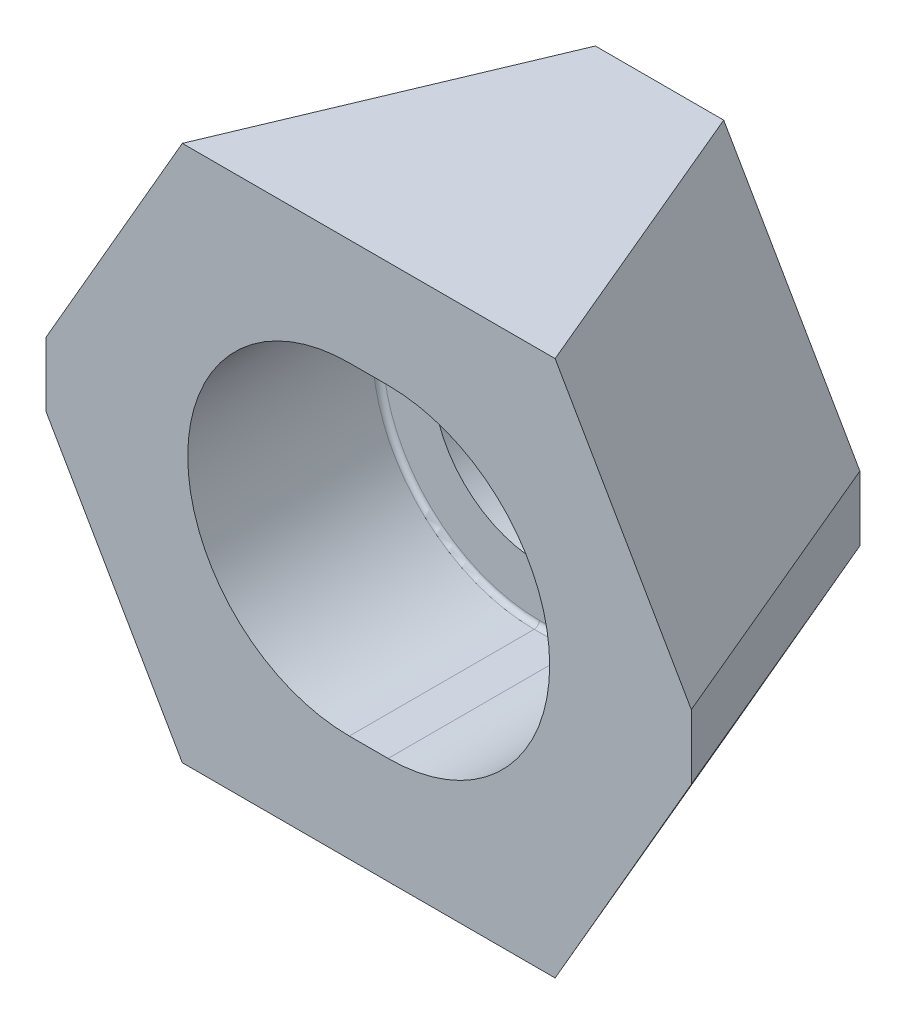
ISO-10303-21;
HEADER;
FILE_DESCRIPTION(('STEP AP214'),'2;1');
FILE_NAME('part.step','',(''),(''),'','','');
FILE_SCHEMA(('AUTOMOTIVE_DESIGN { 1 0 10303 214 1 1 1 1 }'));
ENDSEC;
DATA;
#1=APPLICATION_CONTEXT('core data for automotive mechanical design processes');
#2=APPLICATION_PROTOCOL_DEFINITION('international standard','automotive_design',2000,#1);
#3=PRODUCT_CONTEXT('',#1,'mechanical');
#4=PRODUCT('Part','Part','',(#3));
#5=PRODUCT_RELATED_PRODUCT_CATEGORY('part','',(#4));
#6=PRODUCT_DEFINITION_FORMATION('','',#4);
#7=PRODUCT_DEFINITION_CONTEXT('part definition',#1,'design');
#8=PRODUCT_DEFINITION('design','',#6,#7);
#9=PRODUCT_DEFINITION_SHAPE('','',#8);
#10=(LENGTH_UNIT() NAMED_UNIT(*) SI_UNIT(.MILLI.,.METRE.));
#11=(NAMED_UNIT(*) PLANE_ANGLE_UNIT() SI_UNIT($,.RADIAN.));
#12=(NAMED_UNIT(*) SI_UNIT($,.STERADIAN.) SOLID_ANGLE_UNIT());
#13=UNCERTAINTY_MEASURE_WITH_UNIT(LENGTH_MEASURE(1.E-05),#10,'distance_accuracy_value','');
#14=(GEOMETRIC_REPRESENTATION_CONTEXT(3) GLOBAL_UNCERTAINTY_ASSIGNED_CONTEXT((#13)) GLOBAL_UNIT_ASSIGNED_CONTEXT((#10,
#11,#12)) REPRESENTATION_CONTEXT('',''));
#15=CARTESIAN_POINT('',(0.,0.,0.));
#16=DIRECTION('',(0.,0.,1.));
#17=DIRECTION('',(1.,0.,0.));
#18=AXIS2_PLACEMENT_3D('',#15,#16,#17);
#19=CARTESIAN_POINT('',(-1.5,0.,22.6));
#20=DIRECTION('',(0.,0.,-1.));
#21=DIRECTION('',(-1.,0.,0.));
#22=AXIS2_PLACEMENT_3D('',#19,#20,#21);
#23=CYLINDRICAL_SURFACE('',#22,8.25);
#24=DIRECTION('',(0.,0.,-1.));
#25=VECTOR('',#24,1.);
#26=CARTESIAN_POINT('',(-1.5,-8.25,22.6));
#27=LINE('',#26,#25);
#28=CARTESIAN_POINT('',(-1.5,-8.25,7.8));
#29=VERTEX_POINT('',#28);
#30=CARTESIAN_POINT('',(-1.5,-8.25,0.));
#31=VERTEX_POINT('',#30);
#32=EDGE_CURVE('E122',#29,#31,#27,.T.);
#33=ORIENTED_EDGE('',*,*,#32,.T.);
#34=CARTESIAN_POINT('',(-1.5,0.,0.));
#35=DIRECTION('',(0.,0.,-1.));
#36=DIRECTION('',(-1.,0.,0.));
#37=AXIS2_PLACEMENT_3D('',#34,#35,#36);
#38=CIRCLE('',#37,8.25);
#39=CARTESIAN_POINT('',(-1.5,8.25,0.));
#40=VERTEX_POINT('',#39);
#41=EDGE_CURVE('E136',#31,#40,#38,.T.);
#42=ORIENTED_EDGE('',*,*,#41,.T.);
#43=DIRECTION('',(0.,0.,1.));
#44=VECTOR('',#43,1.);
#45=CARTESIAN_POINT('',(-1.5,8.25,22.6));
#46=LINE('',#45,#44);
#47=CARTESIAN_POINT('',(-1.5,8.25,7.8));
#48=VERTEX_POINT('',#47);
#49=EDGE_CURVE('E154',#40,#48,#46,.T.);
#50=ORIENTED_EDGE('',*,*,#49,.T.);
#51=CARTESIAN_POINT('',(-1.5,0.,7.8));
#52=DIRECTION('',(0.,0.,-1.));
#53=DIRECTION('',(-1.,0.,0.));
#54=AXIS2_PLACEMENT_3D('',#51,#52,#53);
#55=CIRCLE('',#54,8.25);
#56=EDGE_CURVE('E130',#29,#48,#55,.T.);
#57=ORIENTED_EDGE('',*,*,#56,.F.);
#58=EDGE_LOOP('',(#33,#42,#50,#57));
#59=FACE_BOUND('',#58,.T.);
#60=ADVANCED_FACE('F14',(#59),#23,.F.);
#61=CARTESIAN_POINT('',(1.5,8.25,22.6));
#62=DIRECTION('',(0.,1.,0.));
#63=DIRECTION('',(0.,0.,1.));
#64=AXIS2_PLACEMENT_3D('',#61,#62,#63);
#65=PLANE('',#64);
#66=ORIENTED_EDGE('',*,*,#49,.F.);
#67=DIRECTION('',(1.,0.,0.));
#68=VECTOR('',#67,1.);
#69=CARTESIAN_POINT('',(0.,8.25,0.));
#70=LINE('',#69,#68);
#71=CARTESIAN_POINT('',(1.5,8.25,0.));
#72=VERTEX_POINT('',#71);
#73=EDGE_CURVE('E138',#40,#72,#70,.T.);
#74=ORIENTED_EDGE('',*,*,#73,.T.);
#75=DIRECTION('',(0.,0.,-1.));
#76=VECTOR('',#75,1.);
#77=CARTESIAN_POINT('',(1.5,8.25,22.6));
#78=LINE('',#77,#76);
#79=CARTESIAN_POINT('',(1.5,8.25,7.8));
#80=VERTEX_POINT('',#79);
#81=EDGE_CURVE('E107',#72,#80,#78,.F.);
#82=ORIENTED_EDGE('',*,*,#81,.T.);
#83=DIRECTION('',(1.,0.,0.));
#84=VECTOR('',#83,1.);
#85=CARTESIAN_POINT('',(0.,8.25,7.8));
#86=LINE('',#85,#84);
#87=EDGE_CURVE('E134',#48,#80,#86,.T.);
#88=ORIENTED_EDGE('',*,*,#87,.F.);
#89=EDGE_LOOP('',(#66,#74,#82,#88));
#90=FACE_BOUND('',#89,.T.);
#91=ADVANCED_FACE('F491',(#90),#65,.F.);
#92=CARTESIAN_POINT('',(1.5,0.,22.6));
#93=DIRECTION('',(0.,0.,-1.));
#94=DIRECTION('',(-1.,0.,0.));
#95=AXIS2_PLACEMENT_3D('',#92,#93,#94);
#96=CYLINDRICAL_SURFACE('',#95,8.25);
#97=ORIENTED_EDGE('',*,*,#81,.F.);
#98=CARTESIAN_POINT('',(1.5,0.,0.));
#99=DIRECTION('',(0.,0.,-1.));
#100=DIRECTION('',(-1.,0.,0.));
#101=AXIS2_PLACEMENT_3D('',#98,#99,#100);
#102=CIRCLE('',#101,8.25);
#103=CARTESIAN_POINT('',(1.5,-8.25,0.));
#104=VERTEX_POINT('',#103);
#105=EDGE_CURVE('E118',#72,#104,#102,.T.);
#106=ORIENTED_EDGE('',*,*,#105,.T.);
#107=DIRECTION('',(0.,0.,-1.));
#108=VECTOR('',#107,1.);
#109=CARTESIAN_POINT('',(1.5,-8.25,22.6));
#110=LINE('',#109,#108);
#111=CARTESIAN_POINT('',(1.5,-8.25,7.8));
#112=VERTEX_POINT('',#111);
#113=EDGE_CURVE('E112',#104,#112,#110,.F.);
#114=ORIENTED_EDGE('',*,*,#113,.T.);
#115=CARTESIAN_POINT('',(1.5,0.,7.8));
#116=DIRECTION('',(0.,0.,-1.));
#117=DIRECTION('',(-1.,0.,0.));
#118=AXIS2_PLACEMENT_3D('',#115,#116,#117);
#119=CIRCLE('',#118,8.25);
#120=EDGE_CURVE('E18',#80,#112,#119,.T.);
#121=ORIENTED_EDGE('',*,*,#120,.F.);
#122=EDGE_LOOP('',(#97,#106,#114,#121));
#123=FACE_BOUND('',#122,.T.);
#124=ADVANCED_FACE('F114',(#123),#96,.F.);
#125=CARTESIAN_POINT('',(-1.5,-8.25,22.6));
#126=DIRECTION('',(0.,-1.,0.));
#127=DIRECTION('',(0.,0.,-1.));
#128=AXIS2_PLACEMENT_3D('',#125,#126,#127);
#129=PLANE('',#128);
#130=ORIENTED_EDGE('',*,*,#113,.F.);
#131=DIRECTION('',(1.,0.,0.));
#132=VECTOR('',#131,1.);
#133=CARTESIAN_POINT('',(0.,-8.25,0.));
#134=LINE('',#133,#132);
#135=EDGE_CURVE('E150',#104,#31,#134,.F.);
#136=ORIENTED_EDGE('',*,*,#135,.T.);
#137=ORIENTED_EDGE('',*,*,#32,.F.);
#138=DIRECTION('',(1.,0.,0.));
#139=VECTOR('',#138,1.);
#140=CARTESIAN_POINT('',(0.,-8.25,7.8));
#141=LINE('',#140,#139);
#142=EDGE_CURVE('E125',#112,#29,#141,.F.);
#143=ORIENTED_EDGE('',*,*,#142,.F.);
#144=EDGE_LOOP('',(#130,#136,#137,#143));
#145=FACE_BOUND('',#144,.T.);
#146=ADVANCED_FACE('F126',(#145),#129,.F.);
#147=CARTESIAN_POINT('',(0.,0.,7.8));
#148=DIRECTION('',(0.,0.,1.));
#149=DIRECTION('',(1.,0.,0.));
#150=AXIS2_PLACEMENT_3D('',#147,#148,#149);
#151=PLANE('',#150);
#152=ORIENTED_EDGE('',*,*,#56,.T.);
#153=ORIENTED_EDGE('',*,*,#87,.T.);
#154=ORIENTED_EDGE('',*,*,#120,.T.);
#155=ORIENTED_EDGE('',*,*,#142,.T.);
#156=EDGE_LOOP('',(#152,#153,#154,#155));
#157=FACE_BOUND('',#156,.T.);
#158=CARTESIAN_POINT('',(1.5,0.,7.8));
#159=DIRECTION('',(0.,0.,1.));
#160=DIRECTION('',(1.,0.,0.));
#161=AXIS2_PLACEMENT_3D('',#158,#159,#160);
#162=CIRCLE('',#161,12.1);
#163=CARTESIAN_POINT('',(1.5,12.1,7.8));
#164=VERTEX_POINT('',#163);
#165=CARTESIAN_POINT('',(1.5,-12.1,7.8));
#166=VERTEX_POINT('',#165);
#167=EDGE_CURVE('E147',#164,#166,#162,.F.);
#168=ORIENTED_EDGE('',*,*,#167,.F.);
#169=DIRECTION('',(-1.,0.,0.));
#170=VECTOR('',#169,1.);
#171=CARTESIAN_POINT('',(0.75,12.1,7.8));
#172=LINE('',#171,#170);
#173=CARTESIAN_POINT('',(-1.5,12.1,7.8));
#174=VERTEX_POINT('',#173);
#175=EDGE_CURVE('E148',#164,#174,#172,.T.);
#176=ORIENTED_EDGE('',*,*,#175,.T.);
#177=CARTESIAN_POINT('',(-1.5,0.,7.8));
#178=DIRECTION('',(0.,0.,1.));
#179=DIRECTION('',(1.,0.,0.));
#180=AXIS2_PLACEMENT_3D('',#177,#178,#179);
#181=CIRCLE('',#180,12.1);
#182=CARTESIAN_POINT('',(-1.5,-12.1,7.8));
#183=VERTEX_POINT('',#182);
#184=EDGE_CURVE('E188',#183,#174,#181,.F.);
#185=ORIENTED_EDGE('',*,*,#184,.F.);
#186=DIRECTION('',(1.,0.,0.));
#187=VECTOR('',#186,1.);
#188=CARTESIAN_POINT('',(-0.75,-12.1,7.8));
#189=LINE('',#188,#187);
#190=EDGE_CURVE('E144',#183,#166,#189,.T.);
#191=ORIENTED_EDGE('',*,*,#190,.T.);
#192=EDGE_LOOP('',(#168,#176,#185,#191));
#193=FACE_BOUND('',#192,.T.);
#194=ADVANCED_FACE('F132',(#157,#193),#151,.T.);
#195=CARTESIAN_POINT('',(0.,0.,0.));
#196=DIRECTION('',(0.,0.,1.));
#197=DIRECTION('',(1.,0.,0.));
#198=AXIS2_PLACEMENT_3D('',#195,#196,#197);
#199=PLANE('',#198);
#200=ORIENTED_EDGE('',*,*,#105,.F.);
#201=ORIENTED_EDGE('',*,*,#73,.F.);
#202=ORIENTED_EDGE('',*,*,#41,.F.);
#203=ORIENTED_EDGE('',*,*,#135,.F.);
#204=EDGE_LOOP('',(#200,#201,#202,#203));
#205=FACE_BOUND('',#204,.T.);
#206=DIRECTION('',(0.,1.,0.));
#207=VECTOR('',#206,1.);
#208=CARTESIAN_POINT('',(15.4998347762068,10.375,0.));
#209=LINE('',#208,#207);
#210=CARTESIAN_POINT('',(15.4998347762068,-2.50331425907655,0.));
#211=VERTEX_POINT('',#210);
#212=CARTESIAN_POINT('',(15.4998347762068,2.50331425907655,0.));
#213=VERTEX_POINT('',#212);
#214=EDGE_CURVE('E207',#211,#213,#209,.T.);
#215=ORIENTED_EDGE('',*,*,#214,.F.);
#216=DIRECTION('',(0.5,0.866025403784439,0.));
#217=VECTOR('',#216,1.);
#218=CARTESIAN_POINT('',(15.2925770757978,-2.86229512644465,0.));
#219=LINE('',#218,#217);
#220=CARTESIAN_POINT('',(4.9651058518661,-20.75,0.));
#221=VERTEX_POINT('',#220);
#222=EDGE_CURVE('E213',#221,#211,#219,.T.);
#223=ORIENTED_EDGE('',*,*,#222,.F.);
#224=DIRECTION('',(1.,0.,0.));
#225=VECTOR('',#224,1.);
#226=CARTESIAN_POINT('',(25.,-20.75,0.));
#227=LINE('',#226,#225);
#228=CARTESIAN_POINT('',(-4.9651058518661,-20.75,0.));
#229=VERTEX_POINT('',#228);
#230=EDGE_CURVE('E219',#229,#221,#227,.T.);
#231=ORIENTED_EDGE('',*,*,#230,.F.);
#232=DIRECTION('',(0.5,-0.866025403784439,0.));
#233=VECTOR('',#232,1.);
#234=CARTESIAN_POINT('',(-10.0242558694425,-11.9872951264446,0.));
#235=LINE('',#234,#233);
#236=CARTESIAN_POINT('',(-15.4998347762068,-2.50331425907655,0.));
#237=VERTEX_POINT('',#236);
#238=EDGE_CURVE('E225',#237,#229,#235,.T.);
#239=ORIENTED_EDGE('',*,*,#238,.F.);
#240=DIRECTION('',(0.,1.,0.));
#241=VECTOR('',#240,1.);
#242=CARTESIAN_POINT('',(-15.4998347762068,-10.375,0.));
#243=LINE('',#242,#241);
#244=CARTESIAN_POINT('',(-15.4998347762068,2.50331425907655,0.));
#245=VERTEX_POINT('',#244);
#246=EDGE_CURVE('E230',#245,#237,#243,.F.);
#247=ORIENTED_EDGE('',*,*,#246,.F.);
#248=DIRECTION('',(-0.5,-0.866025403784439,0.));
#249=VECTOR('',#248,1.);
#250=CARTESIAN_POINT('',(-15.2925770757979,2.86229512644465,0.));
#251=LINE('',#250,#249);
#252=CARTESIAN_POINT('',(-4.9651058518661,20.75,0.));
#253=VERTEX_POINT('',#252);
#254=EDGE_CURVE('E191',#253,#245,#251,.T.);
#255=ORIENTED_EDGE('',*,*,#254,.F.);
#256=DIRECTION('',(1.,0.,0.));
#257=VECTOR('',#256,1.);
#258=CARTESIAN_POINT('',(-25.,20.75,0.));
#259=LINE('',#258,#257);
#260=CARTESIAN_POINT('',(4.9651058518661,20.75,0.));
#261=VERTEX_POINT('',#260);
#262=EDGE_CURVE('E292',#261,#253,#259,.F.);
#263=ORIENTED_EDGE('',*,*,#262,.F.);
#264=DIRECTION('',(-0.5,0.866025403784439,0.));
#265=VECTOR('',#264,1.);
#266=CARTESIAN_POINT('',(10.0242558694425,11.9872951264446,0.));
#267=LINE('',#266,#265);
#268=EDGE_CURVE('E200',#213,#261,#267,.T.);
#269=ORIENTED_EDGE('',*,*,#268,.F.);
#270=EDGE_LOOP('',(#215,#223,#231,#239,#247,#255,#263,#269));
#271=FACE_BOUND('',#270,.T.);
#272=ADVANCED_FACE('F337',(#205,#271),#199,.F.);
#273=CARTESIAN_POINT('',(0.75,12.1,8.2));
#274=DIRECTION('',(-1.,0.,0.));
#275=DIRECTION('',(0.,0.,1.));
#276=AXIS2_PLACEMENT_3D('',#273,#274,#275);
#277=CYLINDRICAL_SURFACE('',#276,0.4);
#278=DIRECTION('',(1.,0.,0.));
#279=VECTOR('',#278,1.);
#280=CARTESIAN_POINT('',(1.5,12.5,8.2));
#281=LINE('',#280,#279);
#282=CARTESIAN_POINT('',(1.5,12.5,8.2));
#283=VERTEX_POINT('',#282);
#284=CARTESIAN_POINT('',(-1.5,12.5,8.2));
#285=VERTEX_POINT('',#284);
#286=EDGE_CURVE('E271',#283,#285,#281,.F.);
#287=ORIENTED_EDGE('',*,*,#286,.T.);
#288=CARTESIAN_POINT('',(-1.5,12.1,8.2));
#289=DIRECTION('',(1.,0.,0.));
#290=DIRECTION('',(0.,1.,0.));
#291=AXIS2_PLACEMENT_3D('',#288,#289,#290);
#292=CIRCLE('',#291,0.4);
#293=EDGE_CURVE('E264',#174,#285,#292,.T.);
#294=ORIENTED_EDGE('',*,*,#293,.F.);
#295=ORIENTED_EDGE('',*,*,#175,.F.);
#296=CARTESIAN_POINT('',(1.5,12.1,8.2));
#297=DIRECTION('',(-1.,0.,0.));
#298=DIRECTION('',(0.,0.,1.));
#299=AXIS2_PLACEMENT_3D('',#296,#297,#298);
#300=CIRCLE('',#299,0.4);
#301=EDGE_CURVE('E149',#283,#164,#300,.T.);
#302=ORIENTED_EDGE('',*,*,#301,.F.);
#303=EDGE_LOOP('',(#287,#294,#295,#302));
#304=FACE_BOUND('',#303,.T.);
#305=ADVANCED_FACE('F455',(#304),#277,.F.);
#306=CARTESIAN_POINT('',(1.5,0.,8.2));
#307=DIRECTION('',(0.,0.,1.));
#308=DIRECTION('',(1.,0.,0.));
#309=AXIS2_PLACEMENT_3D('',#306,#307,#308);
#310=TOROIDAL_SURFACE('',#309,12.1,0.4);
#311=CARTESIAN_POINT('',(1.5,-12.1,8.2));
#312=DIRECTION('',(1.,0.,0.));
#313=DIRECTION('',(0.,0.,-1.));
#314=AXIS2_PLACEMENT_3D('',#311,#312,#313);
#315=CIRCLE('',#314,0.4);
#316=CARTESIAN_POINT('',(1.5,-12.5,8.2));
#317=VERTEX_POINT('',#316);
#318=EDGE_CURVE('E146',#166,#317,#315,.F.);
#319=ORIENTED_EDGE('',*,*,#318,.T.);
#320=CARTESIAN_POINT('',(1.5,0.,8.2));
#321=DIRECTION('',(0.,0.,-1.));
#322=DIRECTION('',(-1.,0.,0.));
#323=AXIS2_PLACEMENT_3D('',#320,#321,#322);
#324=CIRCLE('',#323,12.5);
#325=EDGE_CURVE('E274',#317,#283,#324,.F.);
#326=ORIENTED_EDGE('',*,*,#325,.T.);
#327=ORIENTED_EDGE('',*,*,#301,.T.);
#328=ORIENTED_EDGE('',*,*,#167,.T.);
#329=EDGE_LOOP('',(#319,#326,#327,#328));
#330=FACE_BOUND('',#329,.T.);
#331=ADVANCED_FACE('F460',(#330),#310,.F.);
#332=CARTESIAN_POINT('',(-0.75,-12.1,8.2));
#333=DIRECTION('',(1.,0.,0.));
#334=DIRECTION('',(0.,0.,-1.));
#335=AXIS2_PLACEMENT_3D('',#332,#333,#334);
#336=CYLINDRICAL_SURFACE('',#335,0.4);
#337=ORIENTED_EDGE('',*,*,#190,.F.);
#338=CARTESIAN_POINT('',(-1.5,-12.1,8.2));
#339=DIRECTION('',(1.,0.,0.));
#340=DIRECTION('',(0.,1.,0.));
#341=AXIS2_PLACEMENT_3D('',#338,#339,#340);
#342=CIRCLE('',#341,0.4);
#343=CARTESIAN_POINT('',(-1.5,-12.5,8.2));
#344=VERTEX_POINT('',#343);
#345=EDGE_CURVE('E192',#344,#183,#342,.T.);
#346=ORIENTED_EDGE('',*,*,#345,.F.);
#347=DIRECTION('',(1.,0.,0.));
#348=VECTOR('',#347,1.);
#349=CARTESIAN_POINT('',(-1.5,-12.5,8.2));
#350=LINE('',#349,#348);
#351=EDGE_CURVE('E249',#344,#317,#350,.T.);
#352=ORIENTED_EDGE('',*,*,#351,.T.);
#353=ORIENTED_EDGE('',*,*,#318,.F.);
#354=EDGE_LOOP('',(#337,#346,#352,#353));
#355=FACE_BOUND('',#354,.T.);
#356=ADVANCED_FACE('F470',(#355),#336,.F.);
#357=CARTESIAN_POINT('',(-1.5,0.,8.2));
#358=DIRECTION('',(0.,0.,1.));
#359=DIRECTION('',(1.,0.,0.));
#360=AXIS2_PLACEMENT_3D('',#357,#358,#359);
#361=TOROIDAL_SURFACE('',#360,12.1,0.4);
#362=ORIENTED_EDGE('',*,*,#345,.T.);
#363=ORIENTED_EDGE('',*,*,#184,.T.);
#364=ORIENTED_EDGE('',*,*,#293,.T.);
#365=CARTESIAN_POINT('',(-1.5,0.,8.2));
#366=DIRECTION('',(0.,0.,-1.));
#367=DIRECTION('',(-1.,0.,0.));
#368=AXIS2_PLACEMENT_3D('',#365,#366,#367);
#369=CIRCLE('',#368,12.5);
#370=EDGE_CURVE('E256',#285,#344,#369,.F.);
#371=ORIENTED_EDGE('',*,*,#370,.T.);
#372=EDGE_LOOP('',(#362,#363,#364,#371));
#373=FACE_BOUND('',#372,.T.);
#374=ADVANCED_FACE('F16',(#373),#361,.F.);
#375=CARTESIAN_POINT('',(-18.8544214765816,4.9187269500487,11.3));
#376=DIRECTION('',(-0.813797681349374,0.469846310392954,-0.342020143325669));
#377=DIRECTION('',(-0.5,-0.866025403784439,0.));
#378=AXIS2_PLACEMENT_3D('',#375,#376,#377);
#379=PLANE('',#378);
#380=ORIENTED_EDGE('',*,*,#254,.T.);
#381=DIRECTION('',(0.387515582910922,0.00013518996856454,-0.921863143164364));
#382=VECTOR('',#381,1.);
#383=CARTESIAN_POINT('',(-24.9579638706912,2.5000146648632,22.5));
#384=LINE('',#383,#382);
#385=CARTESIAN_POINT('',(-24.9579638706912,2.50001466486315,22.5));
#386=VERTEX_POINT('',#385);
#387=EDGE_CURVE('E232',#386,#245,#384,.T.);
#388=ORIENTED_EDGE('',*,*,#387,.F.);
#389=DIRECTION('',(-0.5,-0.866025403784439,0.));
#390=VECTOR('',#389,1.);
#391=CARTESIAN_POINT('',(-14.4213299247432,20.75,22.5));
#392=LINE('',#391,#390);
#393=CARTESIAN_POINT('',(-14.4213299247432,20.75,22.5));
#394=VERTEX_POINT('',#393);
#395=EDGE_CURVE('E185',#394,#386,#392,.T.);
#396=ORIENTED_EDGE('',*,*,#395,.F.);
#397=DIRECTION('',(-0.387449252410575,0.,0.921891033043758));
#398=VECTOR('',#397,1.);
#399=CARTESIAN_POINT('',(-4.9651058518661,20.75,0.));
#400=LINE('',#399,#398);
#401=EDGE_CURVE('E275',#253,#394,#400,.T.);
#402=ORIENTED_EDGE('',*,*,#401,.F.);
#403=EDGE_LOOP('',(#380,#388,#396,#402));
#404=FACE_BOUND('',#403,.T.);
#405=ADVANCED_FACE('F349',(#404),#379,.T.);
#406=CARTESIAN_POINT('',(-20.2499173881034,-10.375,11.3));
#407=DIRECTION('',(-0.921863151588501,0.,-0.387515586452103));
#408=DIRECTION('',(-0.387515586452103,0.,0.921863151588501));
#409=AXIS2_PLACEMENT_3D('',#406,#407,#408);
#410=PLANE('',#409);
#411=ORIENTED_EDGE('',*,*,#246,.T.);
#412=DIRECTION('',(0.387515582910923,-0.000135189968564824,-0.921863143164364));
#413=VECTOR('',#412,1.);
#414=CARTESIAN_POINT('',(-24.9579638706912,-2.50001466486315,22.5));
#415=LINE('',#414,#413);
#416=CARTESIAN_POINT('',(-24.9579638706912,-2.50001466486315,22.5));
#417=VERTEX_POINT('',#416);
#418=EDGE_CURVE('E228',#417,#237,#415,.T.);
#419=ORIENTED_EDGE('',*,*,#418,.F.);
#420=DIRECTION('',(0.,1.,0.));
#421=VECTOR('',#420,1.);
#422=CARTESIAN_POINT('',(-24.9579638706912,0.,22.5));
#423=LINE('',#422,#421);
#424=EDGE_CURVE('E182',#386,#417,#423,.F.);
#425=ORIENTED_EDGE('',*,*,#424,.F.);
#426=ORIENTED_EDGE('',*,*,#387,.T.);
#427=EDGE_LOOP('',(#411,#419,#425,#426));
#428=FACE_BOUND('',#427,.T.);
#429=ADVANCED_FACE('F347',(#428),#410,.T.);
#430=CARTESIAN_POINT('',(-13.5861002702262,-14.0437269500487,11.3));
#431=DIRECTION('',(-0.813797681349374,-0.469846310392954,-0.342020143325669));
#432=DIRECTION('',(0.5,-0.866025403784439,0.));
#433=AXIS2_PLACEMENT_3D('',#430,#431,#432);
#434=PLANE('',#433);
#435=ORIENTED_EDGE('',*,*,#238,.T.);
#436=DIRECTION('',(0.387449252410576,0.,-0.921891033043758));
#437=VECTOR('',#436,1.);
#438=CARTESIAN_POINT('',(-14.4213299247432,-20.75,22.5));
#439=LINE('',#438,#437);
#440=CARTESIAN_POINT('',(-14.4213299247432,-20.75,22.5));
#441=VERTEX_POINT('',#440);
#442=EDGE_CURVE('E222',#441,#229,#439,.T.);
#443=ORIENTED_EDGE('',*,*,#442,.F.);
#444=DIRECTION('',(0.5,-0.866025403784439,0.));
#445=VECTOR('',#444,1.);
#446=CARTESIAN_POINT('',(-24.9579638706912,-2.50001466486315,22.5));
#447=LINE('',#446,#445);
#448=EDGE_CURVE('E179',#417,#441,#447,.T.);
#449=ORIENTED_EDGE('',*,*,#448,.F.);
#450=ORIENTED_EDGE('',*,*,#418,.T.);
#451=EDGE_LOOP('',(#435,#443,#449,#450));
#452=FACE_BOUND('',#451,.T.);
#453=ADVANCED_FACE('F334',(#452),#434,.T.);
#454=CARTESIAN_POINT('',(25.,-20.75,0.));
#455=DIRECTION('',(0.,-1.,0.));
#456=DIRECTION('',(0.,0.,-1.));
#457=AXIS2_PLACEMENT_3D('',#454,#455,#456);
#458=PLANE('',#457);
#459=ORIENTED_EDGE('',*,*,#230,.T.);
#460=DIRECTION('',(-0.387449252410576,0.,-0.921891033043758));
#461=VECTOR('',#460,1.);
#462=CARTESIAN_POINT('',(14.4213299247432,-20.75,22.5));
#463=LINE('',#462,#461);
#464=CARTESIAN_POINT('',(14.4213299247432,-20.75,22.5));
#465=VERTEX_POINT('',#464);
#466=EDGE_CURVE('E216',#465,#221,#463,.T.);
#467=ORIENTED_EDGE('',*,*,#466,.F.);
#468=DIRECTION('',(1.,0.,0.));
#469=VECTOR('',#468,1.);
#470=CARTESIAN_POINT('',(0.,-20.75,22.5));
#471=LINE('',#470,#469);
#472=EDGE_CURVE('E176',#441,#465,#471,.T.);
#473=ORIENTED_EDGE('',*,*,#472,.F.);
#474=ORIENTED_EDGE('',*,*,#442,.T.);
#475=EDGE_LOOP('',(#459,#467,#473,#474));
#476=FACE_BOUND('',#475,.T.);
#477=ADVANCED_FACE('F327',(#476),#458,.T.);
#478=CARTESIAN_POINT('',(18.8544214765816,-4.9187269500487,11.3));
#479=DIRECTION('',(0.813797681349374,-0.469846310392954,-0.342020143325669));
#480=DIRECTION('',(0.5,0.866025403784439,0.));
#481=AXIS2_PLACEMENT_3D('',#478,#479,#480);
#482=PLANE('',#481);
#483=ORIENTED_EDGE('',*,*,#222,.T.);
#484=DIRECTION('',(-0.387515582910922,-0.000135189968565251,-0.921863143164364));
#485=VECTOR('',#484,1.);
#486=CARTESIAN_POINT('',(24.9579638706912,-2.50001466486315,22.5));
#487=LINE('',#486,#485);
#488=CARTESIAN_POINT('',(24.9579638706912,-2.50001466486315,22.5));
#489=VERTEX_POINT('',#488);
#490=EDGE_CURVE('E210',#489,#211,#487,.T.);
#491=ORIENTED_EDGE('',*,*,#490,.F.);
#492=DIRECTION('',(0.5,0.866025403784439,0.));
#493=VECTOR('',#492,1.);
#494=CARTESIAN_POINT('',(14.4213299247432,-20.75,22.5));
#495=LINE('',#494,#493);
#496=EDGE_CURVE('E173',#465,#489,#495,.T.);
#497=ORIENTED_EDGE('',*,*,#496,.F.);
#498=ORIENTED_EDGE('',*,*,#466,.T.);
#499=EDGE_LOOP('',(#483,#491,#497,#498));
#500=FACE_BOUND('',#499,.T.);
#501=ADVANCED_FACE('F343',(#500),#482,.T.);
#502=CARTESIAN_POINT('',(20.2499173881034,10.375,11.3));
#503=DIRECTION('',(0.921863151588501,0.,-0.387515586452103));
#504=DIRECTION('',(-0.387515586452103,0.,-0.921863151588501));
#505=AXIS2_PLACEMENT_3D('',#502,#503,#504);
#506=PLANE('',#505);
#507=ORIENTED_EDGE('',*,*,#214,.T.);
#508=DIRECTION('',(-0.387515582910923,0.000135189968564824,-0.921863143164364));
#509=VECTOR('',#508,1.);
#510=CARTESIAN_POINT('',(24.9579638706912,2.50001466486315,22.5));
#511=LINE('',#510,#509);
#512=CARTESIAN_POINT('',(24.9579638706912,2.50001466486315,22.5));
#513=VERTEX_POINT('',#512);
#514=EDGE_CURVE('E204',#513,#213,#511,.T.);
#515=ORIENTED_EDGE('',*,*,#514,.F.);
#516=DIRECTION('',(0.,1.,0.));
#517=VECTOR('',#516,1.);
#518=CARTESIAN_POINT('',(24.9579638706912,0.,22.5));
#519=LINE('',#518,#517);
#520=EDGE_CURVE('E170',#489,#513,#519,.T.);
#521=ORIENTED_EDGE('',*,*,#520,.F.);
#522=ORIENTED_EDGE('',*,*,#490,.T.);
#523=EDGE_LOOP('',(#507,#515,#521,#522));
#524=FACE_BOUND('',#523,.T.);
#525=ADVANCED_FACE('F388',(#524),#506,.T.);
#526=CARTESIAN_POINT('',(13.5861002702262,14.0437269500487,11.3));
#527=DIRECTION('',(0.813797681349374,0.469846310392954,-0.342020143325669));
#528=DIRECTION('',(-0.5,0.866025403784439,0.));
#529=AXIS2_PLACEMENT_3D('',#526,#527,#528);
#530=PLANE('',#529);
#531=ORIENTED_EDGE('',*,*,#268,.T.);
#532=DIRECTION('',(-0.387449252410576,0.,-0.921891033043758));
#533=VECTOR('',#532,1.);
#534=CARTESIAN_POINT('',(14.4213299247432,20.75,22.5));
#535=LINE('',#534,#533);
#536=CARTESIAN_POINT('',(14.4213299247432,20.75,22.5));
#537=VERTEX_POINT('',#536);
#538=EDGE_CURVE('E203',#537,#261,#535,.T.);
#539=ORIENTED_EDGE('',*,*,#538,.F.);
#540=DIRECTION('',(-0.5,0.866025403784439,0.));
#541=VECTOR('',#540,1.);
#542=CARTESIAN_POINT('',(24.9579638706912,2.50001466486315,22.5));
#543=LINE('',#542,#541);
#544=EDGE_CURVE('E167',#513,#537,#543,.T.);
#545=ORIENTED_EDGE('',*,*,#544,.F.);
#546=ORIENTED_EDGE('',*,*,#514,.T.);
#547=EDGE_LOOP('',(#531,#539,#545,#546));
#548=FACE_BOUND('',#547,.T.);
#549=ADVANCED_FACE('F385',(#548),#530,.T.);
#550=CARTESIAN_POINT('',(-25.,20.75,0.));
#551=DIRECTION('',(0.,1.,0.));
#552=DIRECTION('',(0.,0.,1.));
#553=AXIS2_PLACEMENT_3D('',#550,#551,#552);
#554=PLANE('',#553);
#555=ORIENTED_EDGE('',*,*,#262,.T.);
#556=ORIENTED_EDGE('',*,*,#401,.T.);
#557=DIRECTION('',(1.,0.,0.));
#558=VECTOR('',#557,1.);
#559=CARTESIAN_POINT('',(0.,20.75,22.5));
#560=LINE('',#559,#558);
#561=EDGE_CURVE('E164',#537,#394,#560,.F.);
#562=ORIENTED_EDGE('',*,*,#561,.F.);
#563=ORIENTED_EDGE('',*,*,#538,.T.);
#564=EDGE_LOOP('',(#555,#556,#562,#563));
#565=FACE_BOUND('',#564,.T.);
#566=ADVANCED_FACE('F381',(#565),#554,.T.);
#567=CARTESIAN_POINT('',(1.5,12.5,22.6));
#568=DIRECTION('',(0.,1.,0.));
#569=DIRECTION('',(0.,0.,1.));
#570=AXIS2_PLACEMENT_3D('',#567,#568,#569);
#571=PLANE('',#570);
#572=DIRECTION('',(0.,0.,-1.));
#573=VECTOR('',#572,1.);
#574=CARTESIAN_POINT('',(-1.5,12.5,22.6));
#575=LINE('',#574,#573);
#576=CARTESIAN_POINT('',(-1.5,12.5,22.5));
#577=VERTEX_POINT('',#576);
#578=EDGE_CURVE('E259',#577,#285,#575,.T.);
#579=ORIENTED_EDGE('',*,*,#578,.T.);
#580=ORIENTED_EDGE('',*,*,#286,.F.);
#581=DIRECTION('',(0.,0.,-1.));
#582=VECTOR('',#581,1.);
#583=CARTESIAN_POINT('',(1.5,12.5,22.6));
#584=LINE('',#583,#582);
#585=CARTESIAN_POINT('',(1.5,12.5,22.5));
#586=VERTEX_POINT('',#585);
#587=EDGE_CURVE('E253',#283,#586,#584,.F.);
#588=ORIENTED_EDGE('',*,*,#587,.T.);
#589=DIRECTION('',(1.,0.,0.));
#590=VECTOR('',#589,1.);
#591=CARTESIAN_POINT('',(0.,12.5,22.5));
#592=LINE('',#591,#590);
#593=EDGE_CURVE('E161',#577,#586,#592,.T.);
#594=ORIENTED_EDGE('',*,*,#593,.F.);
#595=EDGE_LOOP('',(#579,#580,#588,#594));
#596=FACE_BOUND('',#595,.T.);
#597=ADVANCED_FACE('F377',(#596),#571,.F.);
#598=CARTESIAN_POINT('',(1.5,0.,22.6));
#599=DIRECTION('',(0.,0.,-1.));
#600=DIRECTION('',(-1.,0.,0.));
#601=AXIS2_PLACEMENT_3D('',#598,#599,#600);
#602=CYLINDRICAL_SURFACE('',#601,12.5);
#603=ORIENTED_EDGE('',*,*,#587,.F.);
#604=ORIENTED_EDGE('',*,*,#325,.F.);
#605=DIRECTION('',(0.,0.,-1.));
#606=VECTOR('',#605,1.);
#607=CARTESIAN_POINT('',(1.5,-12.5,22.6));
#608=LINE('',#607,#606);
#609=CARTESIAN_POINT('',(1.5,-12.5,22.5));
#610=VERTEX_POINT('',#609);
#611=EDGE_CURVE('E252',#317,#610,#608,.F.);
#612=ORIENTED_EDGE('',*,*,#611,.T.);
#613=CARTESIAN_POINT('',(1.5,0.,22.5));
#614=DIRECTION('',(0.,0.,-1.));
#615=DIRECTION('',(-1.,0.,0.));
#616=AXIS2_PLACEMENT_3D('',#613,#614,#615);
#617=CIRCLE('',#616,12.5);
#618=EDGE_CURVE('E158',#586,#610,#617,.T.);
#619=ORIENTED_EDGE('',*,*,#618,.F.);
#620=EDGE_LOOP('',(#603,#604,#612,#619));
#621=FACE_BOUND('',#620,.T.);
#622=ADVANCED_FACE('F374',(#621),#602,.F.);
#623=CARTESIAN_POINT('',(-1.5,-12.5,22.6));
#624=DIRECTION('',(0.,-1.,0.));
#625=DIRECTION('',(0.,0.,-1.));
#626=AXIS2_PLACEMENT_3D('',#623,#624,#625);
#627=PLANE('',#626);
#628=ORIENTED_EDGE('',*,*,#611,.F.);
#629=ORIENTED_EDGE('',*,*,#351,.F.);
#630=DIRECTION('',(0.,0.,-1.));
#631=VECTOR('',#630,1.);
#632=CARTESIAN_POINT('',(-1.5,-12.5,22.6));
#633=LINE('',#632,#631);
#634=CARTESIAN_POINT('',(-1.5,-12.5,22.5));
#635=VERTEX_POINT('',#634);
#636=EDGE_CURVE('E33',#344,#635,#633,.F.);
#637=ORIENTED_EDGE('',*,*,#636,.T.);
#638=DIRECTION('',(1.,0.,0.));
#639=VECTOR('',#638,1.);
#640=CARTESIAN_POINT('',(0.,-12.5,22.5));
#641=LINE('',#640,#639);
#642=EDGE_CURVE('E24',#610,#635,#641,.F.);
#643=ORIENTED_EDGE('',*,*,#642,.F.);
#644=EDGE_LOOP('',(#628,#629,#637,#643));
#645=FACE_BOUND('',#644,.T.);
#646=ADVANCED_FACE('F368',(#645),#627,.F.);
#647=CARTESIAN_POINT('',(-1.5,0.,22.6));
#648=DIRECTION('',(0.,0.,-1.));
#649=DIRECTION('',(-1.,0.,0.));
#650=AXIS2_PLACEMENT_3D('',#647,#648,#649);
#651=CYLINDRICAL_SURFACE('',#650,12.5);
#652=ORIENTED_EDGE('',*,*,#636,.F.);
#653=ORIENTED_EDGE('',*,*,#370,.F.);
#654=ORIENTED_EDGE('',*,*,#578,.F.);
#655=CARTESIAN_POINT('',(-1.5,0.,22.5));
#656=DIRECTION('',(0.,0.,-1.));
#657=DIRECTION('',(-1.,0.,0.));
#658=AXIS2_PLACEMENT_3D('',#655,#656,#657);
#659=CIRCLE('',#658,12.5);
#660=EDGE_CURVE('E9',#635,#577,#659,.T.);
#661=ORIENTED_EDGE('',*,*,#660,.F.);
#662=EDGE_LOOP('',(#652,#653,#654,#661));
#663=FACE_BOUND('',#662,.T.);
#664=ADVANCED_FACE('F361',(#663),#651,.F.);
#665=CARTESIAN_POINT('',(0.,0.,22.5));
#666=DIRECTION('',(0.,0.,1.));
#667=DIRECTION('',(1.,0.,0.));
#668=AXIS2_PLACEMENT_3D('',#665,#666,#667);
#669=PLANE('',#668);
#670=ORIENTED_EDGE('',*,*,#642,.T.);
#671=ORIENTED_EDGE('',*,*,#660,.T.);
#672=ORIENTED_EDGE('',*,*,#593,.T.);
#673=ORIENTED_EDGE('',*,*,#618,.T.);
#674=EDGE_LOOP('',(#670,#671,#672,#673));
#675=FACE_BOUND('',#674,.T.);
#676=ORIENTED_EDGE('',*,*,#544,.T.);
#677=ORIENTED_EDGE('',*,*,#561,.T.);
#678=ORIENTED_EDGE('',*,*,#395,.T.);
#679=ORIENTED_EDGE('',*,*,#424,.T.);
#680=ORIENTED_EDGE('',*,*,#448,.T.);
#681=ORIENTED_EDGE('',*,*,#472,.T.);
#682=ORIENTED_EDGE('',*,*,#496,.T.);
#683=ORIENTED_EDGE('',*,*,#520,.T.);
#684=EDGE_LOOP('',(#676,#677,#678,#679,#680,#681,#682,#683));
#685=FACE_BOUND('',#684,.T.);
#686=ADVANCED_FACE('F346',(#675,#685),#669,.T.);
#687=CLOSED_SHELL('',(#60,#91,#124,#146,#194,#272,#305,#331,#356,#374,#405,#429,#453,#477,#501,
#525,#549,#566,#597,#622,#646,#664,#686));
#688=MANIFOLD_SOLID_BREP('B1',#687);
#689=ADVANCED_BREP_SHAPE_REPRESENTATION('',(#18,#688),#14);
#690=SHAPE_DEFINITION_REPRESENTATION(#9,#689);
ENDSEC;
END-ISO-10303-21;
